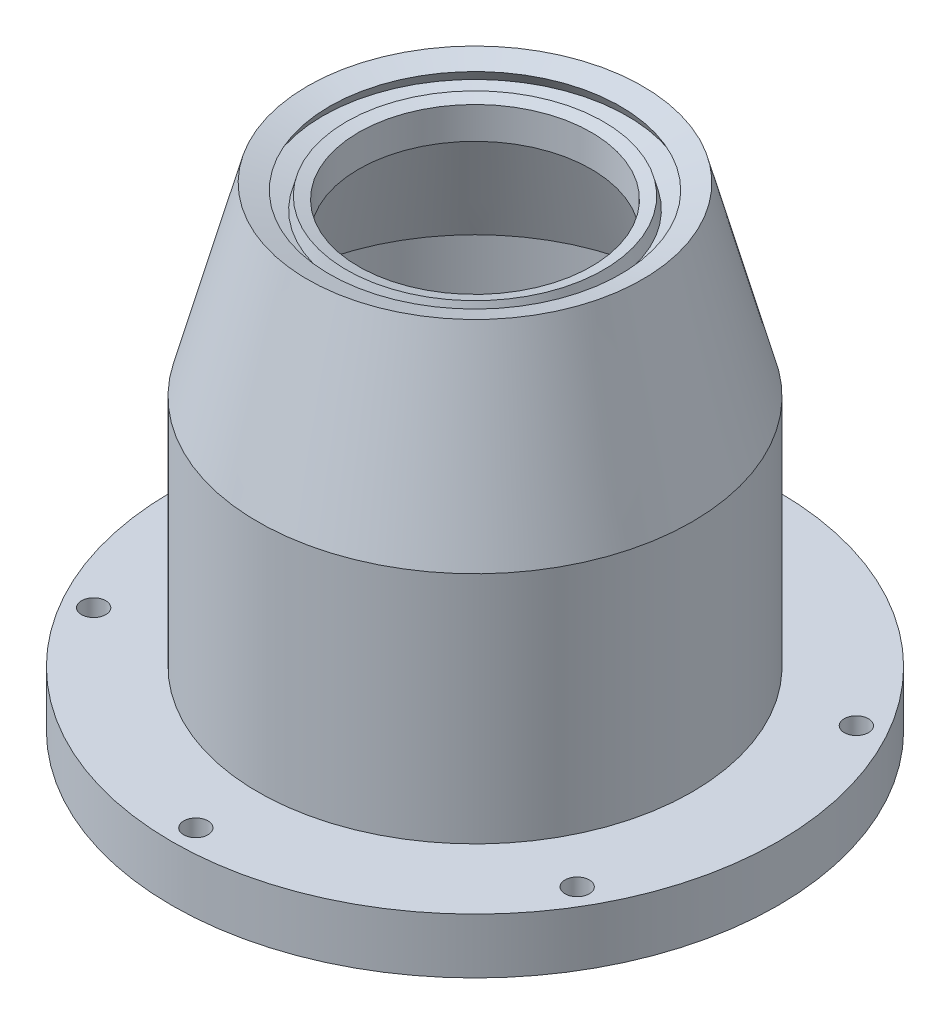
ISO-10303-21;
HEADER;
FILE_DESCRIPTION(('STEP AP214'),'2;1');
FILE_NAME('part.step','',(''),(''),'','','');
FILE_SCHEMA(('AUTOMOTIVE_DESIGN { 1 0 10303 214 1 1 1 1 }'));
ENDSEC;
DATA;
#1=APPLICATION_CONTEXT('core data for automotive mechanical design processes');
#2=APPLICATION_PROTOCOL_DEFINITION('international standard','automotive_design',2000,#1);
#3=PRODUCT_CONTEXT('',#1,'mechanical');
#4=PRODUCT('Part','Part','',(#3));
#5=PRODUCT_RELATED_PRODUCT_CATEGORY('part','',(#4));
#6=PRODUCT_DEFINITION_FORMATION('','',#4);
#7=PRODUCT_DEFINITION_CONTEXT('part definition',#1,'design');
#8=PRODUCT_DEFINITION('design','',#6,#7);
#9=PRODUCT_DEFINITION_SHAPE('','',#8);
#10=(LENGTH_UNIT() NAMED_UNIT(*) SI_UNIT(.MILLI.,.METRE.));
#11=(NAMED_UNIT(*) PLANE_ANGLE_UNIT() SI_UNIT($,.RADIAN.));
#12=(NAMED_UNIT(*) SI_UNIT($,.STERADIAN.) SOLID_ANGLE_UNIT());
#13=UNCERTAINTY_MEASURE_WITH_UNIT(LENGTH_MEASURE(1.E-05),#10,'distance_accuracy_value','');
#14=(GEOMETRIC_REPRESENTATION_CONTEXT(3) GLOBAL_UNCERTAINTY_ASSIGNED_CONTEXT((#13)) GLOBAL_UNIT_ASSIGNED_CONTEXT((#10,
#11,#12)) REPRESENTATION_CONTEXT('',''));
#15=CARTESIAN_POINT('',(0.,0.,0.));
#16=DIRECTION('',(0.,0.,1.));
#17=DIRECTION('',(1.,0.,0.));
#18=AXIS2_PLACEMENT_3D('',#15,#16,#17);
#19=CARTESIAN_POINT('',(0.,-105.308670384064,0.));
#20=DIRECTION('',(0.,-1.,0.));
#21=DIRECTION('',(1.,0.,0.));
#22=AXIS2_PLACEMENT_3D('',#19,#20,#21);
#23=CONICAL_SURFACE('',#22,32.5222884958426,0.26179938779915);
#24=CARTESIAN_POINT('',(0.,-133.35,0.));
#25=DIRECTION('',(0.,1.,0.));
#26=DIRECTION('',(-1.,0.,0.));
#27=AXIS2_PLACEMENT_3D('',#24,#25,#26);
#28=CIRCLE('',#27,40.0359401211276);
#29=CARTESIAN_POINT('',(-40.0359401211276,-133.35,0.));
#30=VERTEX_POINT('',#29);
#31=EDGE_CURVE('E89',#30,#30,#28,.T.);
#32=ORIENTED_EDGE('',*,*,#31,.F.);
#33=EDGE_LOOP('',(#32));
#34=FACE_BOUND('',#33,.T.);
#35=CARTESIAN_POINT('',(0.,-105.308670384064,0.));
#36=DIRECTION('',(0.,1.,0.));
#37=DIRECTION('',(-1.,0.,0.));
#38=AXIS2_PLACEMENT_3D('',#35,#36,#37);
#39=CIRCLE('',#38,32.5222884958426);
#40=CARTESIAN_POINT('',(-32.5222884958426,-105.308670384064,0.));
#41=VERTEX_POINT('',#40);
#42=EDGE_CURVE('E10',#41,#41,#39,.T.);
#43=ORIENTED_EDGE('',*,*,#42,.T.);
#44=EDGE_LOOP('',(#43));
#45=FACE_BOUND('',#44,.T.);
#46=ADVANCED_FACE('F31',(#34,#45),#23,.F.);
#47=CARTESIAN_POINT('',(-23.1521,-105.308670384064,0.));
#48=DIRECTION('',(0.,1.,0.));
#49=DIRECTION('',(-1.,0.,0.));
#50=AXIS2_PLACEMENT_3D('',#47,#48,#49);
#51=PLANE('',#50);
#52=ORIENTED_EDGE('',*,*,#42,.F.);
#53=EDGE_LOOP('',(#52));
#54=FACE_BOUND('',#53,.T.);
#55=CARTESIAN_POINT('',(0.,-105.308670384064,0.));
#56=DIRECTION('',(0.,1.,0.));
#57=DIRECTION('',(-1.,0.,0.));
#58=AXIS2_PLACEMENT_3D('',#55,#56,#57);
#59=CIRCLE('',#58,23.1521);
#60=CARTESIAN_POINT('',(-23.1521,-105.308670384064,0.));
#61=VERTEX_POINT('',#60);
#62=EDGE_CURVE('E37',#61,#61,#59,.T.);
#63=ORIENTED_EDGE('',*,*,#62,.T.);
#64=EDGE_LOOP('',(#63));
#65=FACE_BOUND('',#64,.T.);
#66=ADVANCED_FACE('F164',(#54,#65),#51,.F.);
#67=CARTESIAN_POINT('',(0.,0.,0.));
#68=DIRECTION('',(0.,1.,0.));
#69=DIRECTION('',(-1.,0.,0.));
#70=AXIS2_PLACEMENT_3D('',#67,#68,#69);
#71=CYLINDRICAL_SURFACE('',#70,23.1521);
#72=ORIENTED_EDGE('',*,*,#62,.F.);
#73=EDGE_LOOP('',(#72));
#74=FACE_BOUND('',#73,.T.);
#75=CARTESIAN_POINT('',(0.,-98.958670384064,0.));
#76=DIRECTION('',(0.,1.,0.));
#77=DIRECTION('',(-1.,0.,0.));
#78=AXIS2_PLACEMENT_3D('',#75,#76,#77);
#79=CIRCLE('',#78,23.1521);
#80=CARTESIAN_POINT('',(-23.1521,-98.958670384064,0.));
#81=VERTEX_POINT('',#80);
#82=EDGE_CURVE('E41',#81,#81,#79,.T.);
#83=ORIENTED_EDGE('',*,*,#82,.T.);
#84=EDGE_LOOP('',(#83));
#85=FACE_BOUND('',#84,.T.);
#86=ADVANCED_FACE('F169',(#74,#85),#71,.F.);
#87=CARTESIAN_POINT('',(0.,-98.3278970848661,0.));
#88=DIRECTION('',(0.,1.,0.));
#89=DIRECTION('',(-1.,0.,0.));
#90=AXIS2_PLACEMENT_3D('',#87,#88,#89);
#91=CONICAL_SURFACE('',#90,25.5770337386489,1.31631604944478);
#92=ORIENTED_EDGE('',*,*,#82,.F.);
#93=EDGE_LOOP('',(#92));
#94=FACE_BOUND('',#93,.T.);
#95=CARTESIAN_POINT('',(0.,-98.3278970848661,0.));
#96=DIRECTION('',(0.,1.,0.));
#97=DIRECTION('',(-1.,0.,0.));
#98=AXIS2_PLACEMENT_3D('',#95,#96,#97);
#99=CIRCLE('',#98,25.5770337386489);
#100=CARTESIAN_POINT('',(-25.5770337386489,-98.3278970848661,0.));
#101=VERTEX_POINT('',#100);
#102=EDGE_CURVE('E45',#101,#101,#99,.T.);
#103=ORIENTED_EDGE('',*,*,#102,.T.);
#104=EDGE_LOOP('',(#103));
#105=FACE_BOUND('',#104,.T.);
#106=ADVANCED_FACE('F335',(#94,#105),#91,.F.);
#107=CARTESIAN_POINT('',(0.,-100.772294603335,0.));
#108=DIRECTION('',(0.,-1.,0.));
#109=DIRECTION('',(1.,0.,0.));
#110=AXIS2_PLACEMENT_3D('',#107,#108,#109);
#111=CONICAL_SURFACE('',#110,26.2320080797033,0.26179938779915);
#112=ORIENTED_EDGE('',*,*,#102,.F.);
#113=EDGE_LOOP('',(#112));
#114=FACE_BOUND('',#113,.T.);
#115=CARTESIAN_POINT('',(0.,-100.772294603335,0.));
#116=DIRECTION('',(0.,1.,0.));
#117=DIRECTION('',(-1.,0.,0.));
#118=AXIS2_PLACEMENT_3D('',#115,#116,#117);
#119=CIRCLE('',#118,26.2320080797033);
#120=CARTESIAN_POINT('',(-26.2320080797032,-100.772294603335,0.));
#121=VERTEX_POINT('',#120);
#122=EDGE_CURVE('E50',#121,#121,#119,.T.);
#123=ORIENTED_EDGE('',*,*,#122,.T.);
#124=EDGE_LOOP('',(#123));
#125=FACE_BOUND('',#124,.T.);
#126=ADVANCED_FACE('F331',(#114,#125),#111,.T.);
#127=CARTESIAN_POINT('',(0.,-99.68758398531,0.));
#128=DIRECTION('',(0.,1.,0.));
#129=DIRECTION('',(-1.,0.,0.));
#130=AXIS2_PLACEMENT_3D('',#127,#128,#129);
#131=CONICAL_SURFACE('',#130,30.2802032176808,1.30899693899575);
#132=ORIENTED_EDGE('',*,*,#122,.F.);
#133=EDGE_LOOP('',(#132));
#134=FACE_BOUND('',#133,.T.);
#135=CARTESIAN_POINT('',(0.,-99.68758398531,0.));
#136=DIRECTION('',(0.,1.,0.));
#137=DIRECTION('',(-1.,0.,0.));
#138=AXIS2_PLACEMENT_3D('',#135,#136,#137);
#139=CIRCLE('',#138,30.2802032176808);
#140=CARTESIAN_POINT('',(-30.2802032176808,-99.68758398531,0.));
#141=VERTEX_POINT('',#140);
#142=EDGE_CURVE('E53',#141,#141,#139,.T.);
#143=ORIENTED_EDGE('',*,*,#142,.T.);
#144=EDGE_LOOP('',(#143));
#145=FACE_BOUND('',#144,.T.);
#146=ADVANCED_FACE('F327',(#134,#145),#131,.F.);
#147=CARTESIAN_POINT('',(0.,-97.3875092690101,0.));
#148=DIRECTION('',(0.,-1.,0.));
#149=DIRECTION('',(1.,0.,0.));
#150=AXIS2_PLACEMENT_3D('',#147,#148,#149);
#151=CONICAL_SURFACE('',#150,28.9522544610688,0.523598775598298);
#152=ORIENTED_EDGE('',*,*,#142,.F.);
#153=EDGE_LOOP('',(#152));
#154=FACE_BOUND('',#153,.T.);
#155=CARTESIAN_POINT('',(0.,-97.3875092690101,0.));
#156=DIRECTION('',(0.,1.,0.));
#157=DIRECTION('',(-1.,0.,0.));
#158=AXIS2_PLACEMENT_3D('',#155,#156,#157);
#159=CIRCLE('',#158,28.9522544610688);
#160=CARTESIAN_POINT('',(-28.9522544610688,-97.3875092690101,0.));
#161=VERTEX_POINT('',#160);
#162=EDGE_CURVE('E56',#161,#161,#159,.T.);
#163=ORIENTED_EDGE('',*,*,#162,.T.);
#164=EDGE_LOOP('',(#163));
#165=FACE_BOUND('',#164,.T.);
#166=ADVANCED_FACE('F320',(#154,#165),#151,.F.);
#167=CARTESIAN_POINT('',(0.,-96.083823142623,0.));
#168=DIRECTION('',(0.,1.,0.));
#169=DIRECTION('',(-1.,0.,0.));
#170=AXIS2_PLACEMENT_3D('',#167,#168,#169);
#171=CONICAL_SURFACE('',#170,33.3375,1.28182835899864);
#172=ORIENTED_EDGE('',*,*,#162,.F.);
#173=EDGE_LOOP('',(#172));
#174=FACE_BOUND('',#173,.T.);
#175=CARTESIAN_POINT('',(0.,-96.083823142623,0.));
#176=DIRECTION('',(0.,1.,0.));
#177=DIRECTION('',(-1.,0.,0.));
#178=AXIS2_PLACEMENT_3D('',#175,#176,#177);
#179=CIRCLE('',#178,33.3375);
#180=CARTESIAN_POINT('',(-33.3375,-96.083823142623,0.));
#181=VERTEX_POINT('',#180);
#182=EDGE_CURVE('E59',#181,#181,#179,.T.);
#183=ORIENTED_EDGE('',*,*,#182,.T.);
#184=EDGE_LOOP('',(#183));
#185=FACE_BOUND('',#184,.T.);
#186=ADVANCED_FACE('F314',(#174,#185),#171,.F.);
#187=CARTESIAN_POINT('',(0.,-132.93200332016,0.));
#188=DIRECTION('',(0.,-1.,0.));
#189=DIRECTION('',(1.,0.,0.));
#190=AXIS2_PLACEMENT_3D('',#187,#188,#189);
#191=CONICAL_SURFACE('',#190,43.2109401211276,0.26179938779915);
#192=ORIENTED_EDGE('',*,*,#182,.F.);
#193=EDGE_LOOP('',(#192));
#194=FACE_BOUND('',#193,.T.);
#195=CARTESIAN_POINT('',(0.,-132.93200332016,0.));
#196=DIRECTION('',(0.,1.,0.));
#197=DIRECTION('',(-1.,0.,0.));
#198=AXIS2_PLACEMENT_3D('',#195,#196,#197);
#199=CIRCLE('',#198,43.2109401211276);
#200=CARTESIAN_POINT('',(-43.2109401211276,-132.93200332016,0.));
#201=VERTEX_POINT('',#200);
#202=EDGE_CURVE('E62',#201,#201,#199,.T.);
#203=ORIENTED_EDGE('',*,*,#202,.T.);
#204=EDGE_LOOP('',(#203));
#205=FACE_BOUND('',#204,.T.);
#206=ADVANCED_FACE('F309',(#194,#205),#191,.T.);
#207=CARTESIAN_POINT('',(0.,0.,0.));
#208=DIRECTION('',(0.,1.,0.));
#209=DIRECTION('',(-1.,0.,0.));
#210=AXIS2_PLACEMENT_3D('',#207,#208,#209);
#211=CYLINDRICAL_SURFACE('',#210,43.2109401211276);
#212=CARTESIAN_POINT('',(0.,-179.494920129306,0.));
#213=DIRECTION('',(0.,1.,0.));
#214=DIRECTION('',(-1.,0.,0.));
#215=AXIS2_PLACEMENT_3D('',#212,#213,#214);
#216=CIRCLE('',#215,43.2109401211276);
#217=CARTESIAN_POINT('',(-43.2109401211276,-179.494920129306,0.));
#218=VERTEX_POINT('',#217);
#219=EDGE_CURVE('E65',#218,#218,#216,.T.);
#220=ORIENTED_EDGE('',*,*,#219,.T.);
#221=EDGE_LOOP('',(#220));
#222=FACE_BOUND('',#221,.T.);
#223=ORIENTED_EDGE('',*,*,#202,.F.);
#224=EDGE_LOOP('',(#223));
#225=FACE_BOUND('',#224,.T.);
#226=ADVANCED_FACE('F159',(#222,#225),#211,.T.);
#227=CARTESIAN_POINT('',(-60.325,-179.494920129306,0.));
#228=DIRECTION('',(0.,-1.,0.));
#229=DIRECTION('',(1.,0.,0.));
#230=AXIS2_PLACEMENT_3D('',#227,#228,#229);
#231=PLANE('',#230);
#232=CARTESIAN_POINT('',(0.,-179.494920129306,55.5625));
#233=DIRECTION('',(0.,-1.,0.));
#234=DIRECTION('',(1.,0.,0.));
#235=AXIS2_PLACEMENT_3D('',#232,#233,#234);
#236=CIRCLE('',#235,2.41299999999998);
#237=CARTESIAN_POINT('',(2.41300000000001,-179.494920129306,55.5625));
#238=VERTEX_POINT('',#237);
#239=EDGE_CURVE('E122',#238,#238,#236,.T.);
#240=ORIENTED_EDGE('',*,*,#239,.T.);
#241=EDGE_LOOP('',(#240));
#242=FACE_BOUND('',#241,.T.);
#243=CARTESIAN_POINT('',(48.1185364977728,-179.494920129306,27.7812500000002));
#244=DIRECTION('',(0.,-1.,0.));
#245=DIRECTION('',(1.,0.,0.));
#246=AXIS2_PLACEMENT_3D('',#243,#244,#245);
#247=CIRCLE('',#246,2.41299999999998);
#248=CARTESIAN_POINT('',(50.5315364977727,-179.494920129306,27.7812500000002));
#249=VERTEX_POINT('',#248);
#250=EDGE_CURVE('E116',#249,#249,#247,.T.);
#251=ORIENTED_EDGE('',*,*,#250,.T.);
#252=EDGE_LOOP('',(#251));
#253=FACE_BOUND('',#252,.T.);
#254=CARTESIAN_POINT('',(48.1185364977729,-179.494920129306,-27.7812499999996));
#255=DIRECTION('',(0.,-1.,0.));
#256=DIRECTION('',(1.,0.,0.));
#257=AXIS2_PLACEMENT_3D('',#254,#255,#256);
#258=CIRCLE('',#257,2.41299999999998);
#259=CARTESIAN_POINT('',(50.5315364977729,-179.494920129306,-27.7812499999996));
#260=VERTEX_POINT('',#259);
#261=EDGE_CURVE('E110',#260,#260,#258,.T.);
#262=ORIENTED_EDGE('',*,*,#261,.T.);
#263=EDGE_LOOP('',(#262));
#264=FACE_BOUND('',#263,.T.);
#265=CARTESIAN_POINT('',(2.94902990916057E-13,-179.494920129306,-55.5624999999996));
#266=DIRECTION('',(0.,-1.,0.));
#267=DIRECTION('',(1.,0.,0.));
#268=AXIS2_PLACEMENT_3D('',#265,#266,#267);
#269=CIRCLE('',#268,2.41299999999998);
#270=CARTESIAN_POINT('',(2.41300000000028,-179.494920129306,-55.5624999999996));
#271=VERTEX_POINT('',#270);
#272=EDGE_CURVE('E104',#271,#271,#269,.T.);
#273=ORIENTED_EDGE('',*,*,#272,.T.);
#274=EDGE_LOOP('',(#273));
#275=FACE_BOUND('',#274,.T.);
#276=CARTESIAN_POINT('',(-48.1185364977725,-179.494920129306,-27.7812499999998));
#277=DIRECTION('',(0.,-1.,0.));
#278=DIRECTION('',(1.,0.,0.));
#279=AXIS2_PLACEMENT_3D('',#276,#277,#278);
#280=CIRCLE('',#279,2.41299999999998);
#281=CARTESIAN_POINT('',(-45.7055364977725,-179.494920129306,-27.7812499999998));
#282=VERTEX_POINT('',#281);
#283=EDGE_CURVE('E98',#282,#282,#280,.T.);
#284=ORIENTED_EDGE('',*,*,#283,.T.);
#285=EDGE_LOOP('',(#284));
#286=FACE_BOUND('',#285,.T.);
#287=CARTESIAN_POINT('',(-48.1185364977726,-179.494920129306,27.78125));
#288=DIRECTION('',(0.,-1.,0.));
#289=DIRECTION('',(1.,0.,0.));
#290=AXIS2_PLACEMENT_3D('',#287,#288,#289);
#291=CIRCLE('',#290,2.41299999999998);
#292=CARTESIAN_POINT('',(-45.7055364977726,-179.494920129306,27.78125));
#293=VERTEX_POINT('',#292);
#294=EDGE_CURVE('E92',#293,#293,#291,.T.);
#295=ORIENTED_EDGE('',*,*,#294,.T.);
#296=EDGE_LOOP('',(#295));
#297=FACE_BOUND('',#296,.T.);
#298=ORIENTED_EDGE('',*,*,#219,.F.);
#299=EDGE_LOOP('',(#298));
#300=FACE_BOUND('',#299,.T.);
#301=CARTESIAN_POINT('',(0.,-179.494920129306,0.));
#302=DIRECTION('',(0.,1.,0.));
#303=DIRECTION('',(-1.,0.,0.));
#304=AXIS2_PLACEMENT_3D('',#301,#302,#303);
#305=CIRCLE('',#304,60.325);
#306=CARTESIAN_POINT('',(-60.325,-179.494920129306,0.));
#307=VERTEX_POINT('',#306);
#308=EDGE_CURVE('E68',#307,#307,#305,.T.);
#309=ORIENTED_EDGE('',*,*,#308,.T.);
#310=EDGE_LOOP('',(#309));
#311=FACE_BOUND('',#310,.T.);
#312=ADVANCED_FACE('F153',(#242,#253,#264,#275,#286,#297,#300,#311),#231,.F.);
#313=CARTESIAN_POINT('',(0.,0.,0.));
#314=DIRECTION('',(0.,1.,0.));
#315=DIRECTION('',(-1.,0.,0.));
#316=AXIS2_PLACEMENT_3D('',#313,#314,#315);
#317=CYLINDRICAL_SURFACE('',#316,60.325);
#318=ORIENTED_EDGE('',*,*,#308,.F.);
#319=EDGE_LOOP('',(#318));
#320=FACE_BOUND('',#319,.T.);
#321=CARTESIAN_POINT('',(0.,-190.5,0.));
#322=DIRECTION('',(0.,1.,0.));
#323=DIRECTION('',(-1.,0.,0.));
#324=AXIS2_PLACEMENT_3D('',#321,#322,#323);
#325=CIRCLE('',#324,60.325);
#326=CARTESIAN_POINT('',(-60.325,-190.5,0.));
#327=VERTEX_POINT('',#326);
#328=EDGE_CURVE('E71',#327,#327,#325,.T.);
#329=ORIENTED_EDGE('',*,*,#328,.T.);
#330=EDGE_LOOP('',(#329));
#331=FACE_BOUND('',#330,.T.);
#332=ADVANCED_FACE('F136',(#320,#331),#317,.T.);
#333=CARTESIAN_POINT('',(-60.325,-190.5,0.));
#334=DIRECTION('',(0.,-1.,0.));
#335=DIRECTION('',(1.,0.,0.));
#336=AXIS2_PLACEMENT_3D('',#333,#334,#335);
#337=PLANE('',#336);
#338=CARTESIAN_POINT('',(0.,-190.5,55.5625));
#339=DIRECTION('',(0.,-1.,0.));
#340=DIRECTION('',(0.,0.,-1.));
#341=AXIS2_PLACEMENT_3D('',#338,#339,#340);
#342=CIRCLE('',#341,2.41299999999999);
#343=CARTESIAN_POINT('',(0.,-190.5,53.1495));
#344=VERTEX_POINT('',#343);
#345=EDGE_CURVE('E125',#344,#344,#342,.T.);
#346=ORIENTED_EDGE('',*,*,#345,.F.);
#347=EDGE_LOOP('',(#346));
#348=FACE_BOUND('',#347,.T.);
#349=CARTESIAN_POINT('',(48.1185364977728,-190.5,27.7812500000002));
#350=DIRECTION('',(0.,-1.,0.));
#351=DIRECTION('',(0.,0.,-1.));
#352=AXIS2_PLACEMENT_3D('',#349,#350,#351);
#353=CIRCLE('',#352,2.41299999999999);
#354=CARTESIAN_POINT('',(48.1185364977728,-190.5,25.3682500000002));
#355=VERTEX_POINT('',#354);
#356=EDGE_CURVE('E119',#355,#355,#353,.T.);
#357=ORIENTED_EDGE('',*,*,#356,.F.);
#358=EDGE_LOOP('',(#357));
#359=FACE_BOUND('',#358,.T.);
#360=CARTESIAN_POINT('',(48.1185364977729,-190.5,-27.7812499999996));
#361=DIRECTION('',(0.,-1.,0.));
#362=DIRECTION('',(0.,0.,-1.));
#363=AXIS2_PLACEMENT_3D('',#360,#361,#362);
#364=CIRCLE('',#363,2.41299999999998);
#365=CARTESIAN_POINT('',(48.1185364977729,-190.5,-30.1942499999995));
#366=VERTEX_POINT('',#365);
#367=EDGE_CURVE('E113',#366,#366,#364,.T.);
#368=ORIENTED_EDGE('',*,*,#367,.F.);
#369=EDGE_LOOP('',(#368));
#370=FACE_BOUND('',#369,.T.);
#371=CARTESIAN_POINT('',(2.94902990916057E-13,-190.5,-55.5624999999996));
#372=DIRECTION('',(0.,-1.,0.));
#373=DIRECTION('',(0.,0.,-1.));
#374=AXIS2_PLACEMENT_3D('',#371,#372,#373);
#375=CIRCLE('',#374,2.41299999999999);
#376=CARTESIAN_POINT('',(2.94902990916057E-13,-190.5,-57.9754999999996));
#377=VERTEX_POINT('',#376);
#378=EDGE_CURVE('E107',#377,#377,#375,.T.);
#379=ORIENTED_EDGE('',*,*,#378,.F.);
#380=EDGE_LOOP('',(#379));
#381=FACE_BOUND('',#380,.T.);
#382=CARTESIAN_POINT('',(-48.1185364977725,-190.5,-27.7812499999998));
#383=DIRECTION('',(0.,-1.,0.));
#384=DIRECTION('',(0.,0.,-1.));
#385=AXIS2_PLACEMENT_3D('',#382,#383,#384);
#386=CIRCLE('',#385,2.41299999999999);
#387=CARTESIAN_POINT('',(-48.1185364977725,-190.5,-30.1942499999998));
#388=VERTEX_POINT('',#387);
#389=EDGE_CURVE('E101',#388,#388,#386,.T.);
#390=ORIENTED_EDGE('',*,*,#389,.F.);
#391=EDGE_LOOP('',(#390));
#392=FACE_BOUND('',#391,.T.);
#393=CARTESIAN_POINT('',(-48.1185364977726,-190.5,27.78125));
#394=DIRECTION('',(0.,-1.,0.));
#395=DIRECTION('',(0.,0.,-1.));
#396=AXIS2_PLACEMENT_3D('',#393,#394,#395);
#397=CIRCLE('',#396,2.41299999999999);
#398=CARTESIAN_POINT('',(-48.1185364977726,-190.5,25.36825));
#399=VERTEX_POINT('',#398);
#400=EDGE_CURVE('E95',#399,#399,#397,.T.);
#401=ORIENTED_EDGE('',*,*,#400,.F.);
#402=EDGE_LOOP('',(#401));
#403=FACE_BOUND('',#402,.T.);
#404=CARTESIAN_POINT('',(0.,-190.5,0.));
#405=DIRECTION('',(0.,1.,0.));
#406=DIRECTION('',(-1.,0.,0.));
#407=AXIS2_PLACEMENT_3D('',#404,#405,#406);
#408=CIRCLE('',#407,48.9894401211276);
#409=CARTESIAN_POINT('',(-48.9894401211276,-190.5,0.));
#410=VERTEX_POINT('',#409);
#411=EDGE_CURVE('E74',#410,#410,#408,.T.);
#412=ORIENTED_EDGE('',*,*,#411,.T.);
#413=EDGE_LOOP('',(#412));
#414=FACE_BOUND('',#413,.T.);
#415=ORIENTED_EDGE('',*,*,#328,.F.);
#416=EDGE_LOOP('',(#415));
#417=FACE_BOUND('',#416,.T.);
#418=ADVANCED_FACE('F132',(#348,#359,#370,#381,#392,#403,#414,#417),#337,.T.);
#419=CARTESIAN_POINT('',(0.,0.,0.));
#420=DIRECTION('',(0.,1.,0.));
#421=DIRECTION('',(-1.,0.,0.));
#422=AXIS2_PLACEMENT_3D('',#419,#420,#421);
#423=CYLINDRICAL_SURFACE('',#422,48.9894401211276);
#424=CARTESIAN_POINT('',(0.,-184.15,0.));
#425=DIRECTION('',(0.,1.,0.));
#426=DIRECTION('',(-1.,0.,0.));
#427=AXIS2_PLACEMENT_3D('',#424,#425,#426);
#428=CIRCLE('',#427,48.9894401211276);
#429=CARTESIAN_POINT('',(-48.9894401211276,-184.15,0.));
#430=VERTEX_POINT('',#429);
#431=EDGE_CURVE('E77',#430,#430,#428,.T.);
#432=ORIENTED_EDGE('',*,*,#431,.T.);
#433=EDGE_LOOP('',(#432));
#434=FACE_BOUND('',#433,.T.);
#435=ORIENTED_EDGE('',*,*,#411,.F.);
#436=EDGE_LOOP('',(#435));
#437=FACE_BOUND('',#436,.T.);
#438=ADVANCED_FACE('F135',(#434,#437),#423,.F.);
#439=CARTESIAN_POINT('',(-48.9894401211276,-184.15,0.));
#440=DIRECTION('',(0.,-1.,0.));
#441=DIRECTION('',(1.,0.,0.));
#442=AXIS2_PLACEMENT_3D('',#439,#440,#441);
#443=PLANE('',#442);
#444=CARTESIAN_POINT('',(0.,-184.15,0.));
#445=DIRECTION('',(0.,1.,0.));
#446=DIRECTION('',(-1.,0.,0.));
#447=AXIS2_PLACEMENT_3D('',#444,#445,#446);
#448=CIRCLE('',#447,44.7984401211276);
#449=CARTESIAN_POINT('',(-44.7984401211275,-184.15,0.));
#450=VERTEX_POINT('',#449);
#451=EDGE_CURVE('E80',#450,#450,#448,.T.);
#452=ORIENTED_EDGE('',*,*,#451,.T.);
#453=EDGE_LOOP('',(#452));
#454=FACE_BOUND('',#453,.T.);
#455=ORIENTED_EDGE('',*,*,#431,.F.);
#456=EDGE_LOOP('',(#455));
#457=FACE_BOUND('',#456,.T.);
#458=ADVANCED_FACE('F194',(#454,#457),#443,.T.);
#459=CARTESIAN_POINT('',(0.,0.,0.));
#460=DIRECTION('',(0.,1.,0.));
#461=DIRECTION('',(-1.,0.,0.));
#462=AXIS2_PLACEMENT_3D('',#459,#460,#461);
#463=CYLINDRICAL_SURFACE('',#462,44.7984401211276);
#464=ORIENTED_EDGE('',*,*,#451,.F.);
#465=EDGE_LOOP('',(#464));
#466=FACE_BOUND('',#465,.T.);
#467=CARTESIAN_POINT('',(0.,-190.5,0.));
#468=DIRECTION('',(0.,1.,0.));
#469=DIRECTION('',(-1.,0.,0.));
#470=AXIS2_PLACEMENT_3D('',#467,#468,#469);
#471=CIRCLE('',#470,44.7984401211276);
#472=CARTESIAN_POINT('',(-44.7984401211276,-190.5,0.));
#473=VERTEX_POINT('',#472);
#474=EDGE_CURVE('E83',#473,#473,#471,.T.);
#475=ORIENTED_EDGE('',*,*,#474,.T.);
#476=EDGE_LOOP('',(#475));
#477=FACE_BOUND('',#476,.T.);
#478=ADVANCED_FACE('F186',(#466,#477),#463,.T.);
#479=CARTESIAN_POINT('',(-44.7984401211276,-190.5,0.));
#480=DIRECTION('',(0.,-1.,0.));
#481=DIRECTION('',(1.,0.,0.));
#482=AXIS2_PLACEMENT_3D('',#479,#480,#481);
#483=PLANE('',#482);
#484=CARTESIAN_POINT('',(0.,-190.5,0.));
#485=DIRECTION('',(0.,1.,0.));
#486=DIRECTION('',(-1.,0.,0.));
#487=AXIS2_PLACEMENT_3D('',#484,#485,#486);
#488=CIRCLE('',#487,40.0359401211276);
#489=CARTESIAN_POINT('',(-40.0359401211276,-190.5,0.));
#490=VERTEX_POINT('',#489);
#491=EDGE_CURVE('E86',#490,#490,#488,.T.);
#492=ORIENTED_EDGE('',*,*,#491,.T.);
#493=EDGE_LOOP('',(#492));
#494=FACE_BOUND('',#493,.T.);
#495=ORIENTED_EDGE('',*,*,#474,.F.);
#496=EDGE_LOOP('',(#495));
#497=FACE_BOUND('',#496,.T.);
#498=ADVANCED_FACE('F176',(#494,#497),#483,.T.);
#499=CARTESIAN_POINT('',(0.,0.,0.));
#500=DIRECTION('',(0.,1.,0.));
#501=DIRECTION('',(-1.,0.,0.));
#502=AXIS2_PLACEMENT_3D('',#499,#500,#501);
#503=CYLINDRICAL_SURFACE('',#502,40.0359401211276);
#504=ORIENTED_EDGE('',*,*,#491,.F.);
#505=EDGE_LOOP('',(#504));
#506=FACE_BOUND('',#505,.T.);
#507=ORIENTED_EDGE('',*,*,#31,.T.);
#508=EDGE_LOOP('',(#507));
#509=FACE_BOUND('',#508,.T.);
#510=ADVANCED_FACE('F173',(#506,#509),#503,.F.);
#511=CARTESIAN_POINT('',(-48.1185364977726,-190.5,27.78125));
#512=DIRECTION('',(0.,-1.,0.));
#513=DIRECTION('',(0.,0.,-1.));
#514=AXIS2_PLACEMENT_3D('',#511,#512,#513);
#515=CYLINDRICAL_SURFACE('',#514,2.41299999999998);
#516=ORIENTED_EDGE('',*,*,#400,.T.);
#517=EDGE_LOOP('',(#516));
#518=FACE_BOUND('',#517,.T.);
#519=ORIENTED_EDGE('',*,*,#294,.F.);
#520=EDGE_LOOP('',(#519));
#521=FACE_BOUND('',#520,.T.);
#522=ADVANCED_FACE('F175',(#518,#521),#515,.F.);
#523=CARTESIAN_POINT('',(-48.1185364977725,-190.5,-27.7812499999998));
#524=DIRECTION('',(0.,-1.,0.));
#525=DIRECTION('',(0.,0.,-1.));
#526=AXIS2_PLACEMENT_3D('',#523,#524,#525);
#527=CYLINDRICAL_SURFACE('',#526,2.41299999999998);
#528=ORIENTED_EDGE('',*,*,#389,.T.);
#529=EDGE_LOOP('',(#528));
#530=FACE_BOUND('',#529,.T.);
#531=ORIENTED_EDGE('',*,*,#283,.F.);
#532=EDGE_LOOP('',(#531));
#533=FACE_BOUND('',#532,.T.);
#534=ADVANCED_FACE('F183',(#530,#533),#527,.F.);
#535=CARTESIAN_POINT('',(2.94902990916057E-13,-190.5,-55.5624999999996));
#536=DIRECTION('',(0.,-1.,0.));
#537=DIRECTION('',(0.,0.,-1.));
#538=AXIS2_PLACEMENT_3D('',#535,#536,#537);
#539=CYLINDRICAL_SURFACE('',#538,2.41299999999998);
#540=ORIENTED_EDGE('',*,*,#378,.T.);
#541=EDGE_LOOP('',(#540));
#542=FACE_BOUND('',#541,.T.);
#543=ORIENTED_EDGE('',*,*,#272,.F.);
#544=EDGE_LOOP('',(#543));
#545=FACE_BOUND('',#544,.T.);
#546=ADVANCED_FACE('F252',(#542,#545),#539,.F.);
#547=CARTESIAN_POINT('',(48.1185364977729,-190.5,-27.7812499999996));
#548=DIRECTION('',(0.,-1.,0.));
#549=DIRECTION('',(0.,0.,-1.));
#550=AXIS2_PLACEMENT_3D('',#547,#548,#549);
#551=CYLINDRICAL_SURFACE('',#550,2.41299999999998);
#552=ORIENTED_EDGE('',*,*,#367,.T.);
#553=EDGE_LOOP('',(#552));
#554=FACE_BOUND('',#553,.T.);
#555=ORIENTED_EDGE('',*,*,#261,.F.);
#556=EDGE_LOOP('',(#555));
#557=FACE_BOUND('',#556,.T.);
#558=ADVANCED_FACE('F261',(#554,#557),#551,.F.);
#559=CARTESIAN_POINT('',(48.1185364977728,-190.5,27.7812500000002));
#560=DIRECTION('',(0.,-1.,0.));
#561=DIRECTION('',(0.,0.,-1.));
#562=AXIS2_PLACEMENT_3D('',#559,#560,#561);
#563=CYLINDRICAL_SURFACE('',#562,2.41299999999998);
#564=ORIENTED_EDGE('',*,*,#356,.T.);
#565=EDGE_LOOP('',(#564));
#566=FACE_BOUND('',#565,.T.);
#567=ORIENTED_EDGE('',*,*,#250,.F.);
#568=EDGE_LOOP('',(#567));
#569=FACE_BOUND('',#568,.T.);
#570=ADVANCED_FACE('F271',(#566,#569),#563,.F.);
#571=CARTESIAN_POINT('',(0.,-190.5,55.5625));
#572=DIRECTION('',(0.,-1.,0.));
#573=DIRECTION('',(0.,0.,-1.));
#574=AXIS2_PLACEMENT_3D('',#571,#572,#573);
#575=CYLINDRICAL_SURFACE('',#574,2.41299999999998);
#576=ORIENTED_EDGE('',*,*,#345,.T.);
#577=EDGE_LOOP('',(#576));
#578=FACE_BOUND('',#577,.T.);
#579=ORIENTED_EDGE('',*,*,#239,.F.);
#580=EDGE_LOOP('',(#579));
#581=FACE_BOUND('',#580,.T.);
#582=ADVANCED_FACE('F129',(#578,#581),#575,.F.);
#583=CLOSED_SHELL('',(#46,#66,#86,#106,#126,#146,#166,#186,#206,#226,#312,#332,#418,#438,#458,
#478,#498,#510,#522,#534,#546,#558,#570,#582));
#584=MANIFOLD_SOLID_BREP('B2',#583);
#585=ADVANCED_BREP_SHAPE_REPRESENTATION('',(#18,#584),#14);
#586=SHAPE_DEFINITION_REPRESENTATION(#9,#585);
ENDSEC;
END-ISO-10303-21;
